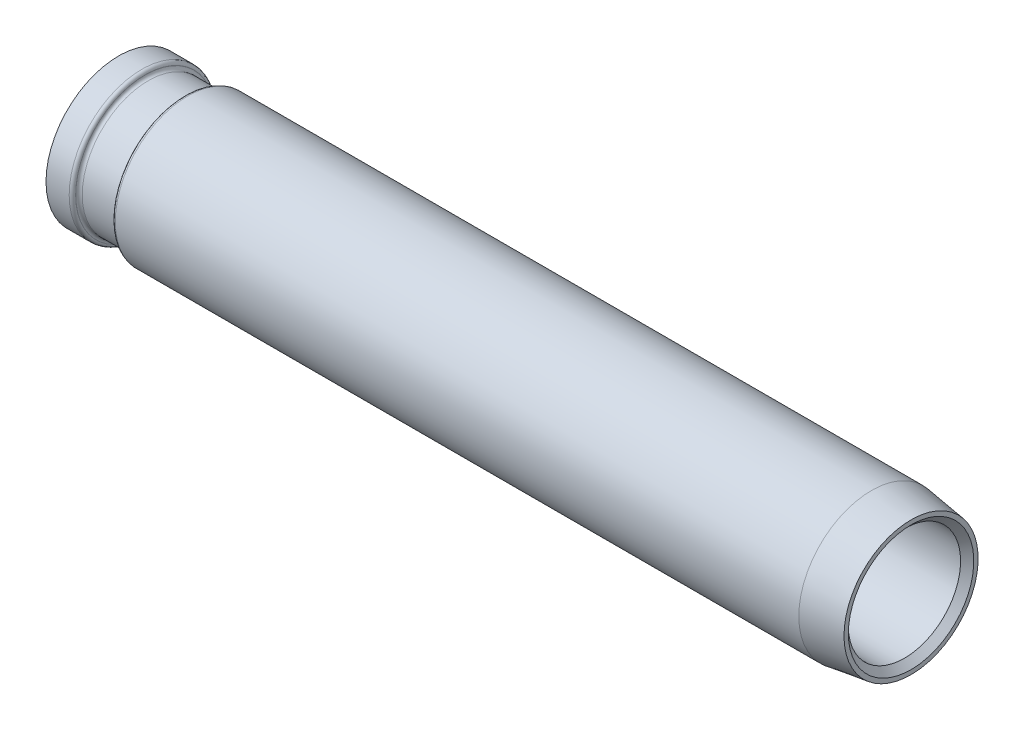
from build123d import *

# Parameters (mm, degrees)
CHANFREIN3_SIZE  = 1
CHANFREIN5_SIZE  = 6
CHANFREIN5_SIZE2 = 0.843245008


with BuildPart() as part:
    # Esquisse1 → R_volution2 (revolve)
    with BuildSketch(Plane.XY, mode=Mode.PRIVATE) as r_volution2_sk:
        with BuildLine():
            Line((-48.347477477, 11), (-48.347477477, 8.5))
            Line((-48.347477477, 8.5), (-44.837477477, 8.5))
            ThreePointArc((-44.837477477, 8.5), (-44.490995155, 8.356482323), (-44.347477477, 8.01))
            Line((-44.347477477, 8.01), (-44.347477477, 8.000618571))
            ThreePointArc((-44.347477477, 8.000618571), (-44.201030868, 7.64706518), (-43.847477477, 7.500618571))
            Line((-43.847477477, 7.500618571), (-38.837477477, 7.500618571))
            ThreePointArc((-38.837477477, 7.500618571), (-38.490995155, 7.644136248), (-38.347477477, 7.990618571))
            Line((-38.347477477, 7.990618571), (-38.347477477, 8))
            ThreePointArc((-38.347477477, 8), (-38.201030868, 8.353553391), (-37.847477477, 8.5))
            Line((-37.847477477, 8.5), (71.652522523, 8.5))
            Line((71.652522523, 8.5), (71.652522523, 11))
            Line((71.652522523, 11), (-37.857477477, 11))
            ThreePointArc((-37.857477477, 11), (-38.2039598, 10.856482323), (-38.347477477, 10.51))
            Line((-38.347477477, 10.51), (-38.347477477, 10.49))
            ThreePointArc((-38.347477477, 10.49), (-38.490995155, 10.143517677), (-38.837477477, 10))
            Line((-38.837477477, 10), (-43.857477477, 10))
            ThreePointArc((-43.857477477, 10), (-44.2039598, 10.143517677), (-44.347477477, 10.49))
            Line((-44.347477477, 10.49), (-44.347477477, 10.51))
            ThreePointArc((-44.347477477, 10.51), (-44.490995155, 10.856482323), (-44.837477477, 11))
            Line((-44.837477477, 11), (-48.347477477, 11))
        make_face()
    revolve(r_volution2_sk.sketch.rotate(Axis((-100.055405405, 0, 0), (1, 0, 0)), 90), axis=Axis((-100.055405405, 0, 0), (1, 0, 0)))

    # Chanfrein3
    chanfrein3_edges = [part.edges().sort_by_distance(p)[0] for p in [
        (71.652522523, 0, -8.5),
        (-48.347477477, 0, -8.5),
    ]]
    chamfer(chanfrein3_edges, length=CHANFREIN3_SIZE)

    # Chanfrein5
    chanfrein5_edges = [part.edges().sort_by_distance(p)[0] for p in [
        (71.652522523, 0, -11),
    ]]
    chanfrein5_side = [part.faces().sort_by_distance(p)[0] for p in [
        (16.897522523, 0, -11),
    ]]
    chamfer(chanfrein5_edges, length=CHANFREIN5_SIZE, length2=CHANFREIN5_SIZE2, reference=chanfrein5_side[0])


solid = part.part
